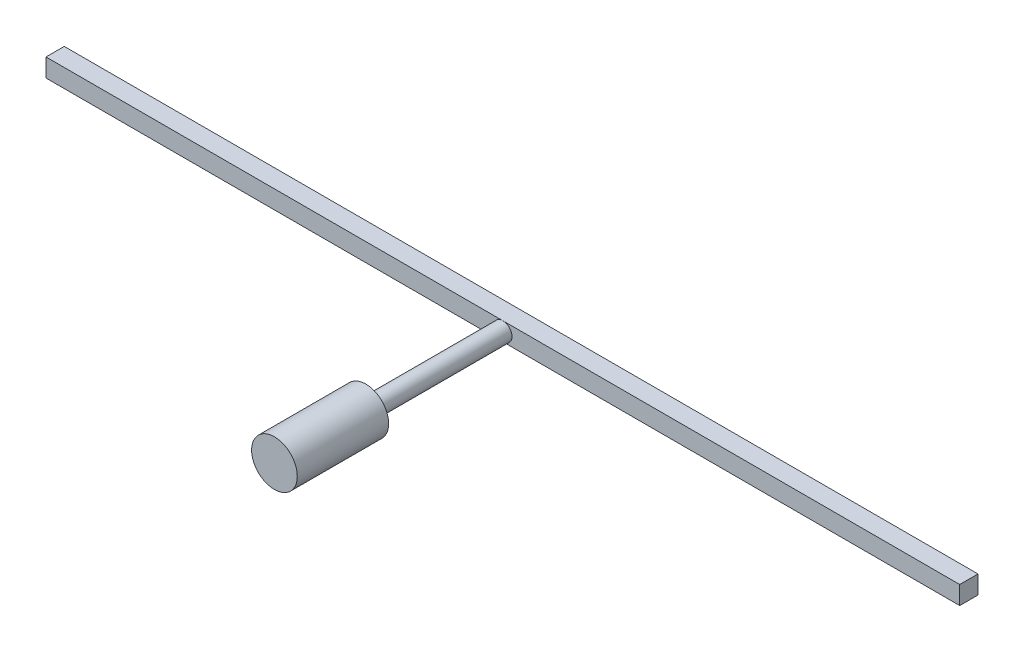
ISO-10303-21;
HEADER;
FILE_DESCRIPTION(('STEP AP214'),'2;1');
FILE_NAME('part.step','',(''),(''),'','','');
FILE_SCHEMA(('AUTOMOTIVE_DESIGN { 1 0 10303 214 1 1 1 1 }'));
ENDSEC;
DATA;
#1=APPLICATION_CONTEXT('core data for automotive mechanical design processes');
#2=APPLICATION_PROTOCOL_DEFINITION('international standard','automotive_design',2000,#1);
#3=PRODUCT_CONTEXT('',#1,'mechanical');
#4=PRODUCT('Part','Part','',(#3));
#5=PRODUCT_RELATED_PRODUCT_CATEGORY('part','',(#4));
#6=PRODUCT_DEFINITION_FORMATION('','',#4);
#7=PRODUCT_DEFINITION_CONTEXT('part definition',#1,'design');
#8=PRODUCT_DEFINITION('design','',#6,#7);
#9=PRODUCT_DEFINITION_SHAPE('','',#8);
#10=(LENGTH_UNIT() NAMED_UNIT(*) SI_UNIT(.MILLI.,.METRE.));
#11=(NAMED_UNIT(*) PLANE_ANGLE_UNIT() SI_UNIT($,.RADIAN.));
#12=(NAMED_UNIT(*) SI_UNIT($,.STERADIAN.) SOLID_ANGLE_UNIT());
#13=UNCERTAINTY_MEASURE_WITH_UNIT(LENGTH_MEASURE(1.E-05),#10,'distance_accuracy_value','');
#14=(GEOMETRIC_REPRESENTATION_CONTEXT(3) GLOBAL_UNCERTAINTY_ASSIGNED_CONTEXT((#13)) GLOBAL_UNIT_ASSIGNED_CONTEXT((#10,
#11,#12)) REPRESENTATION_CONTEXT('',''));
#15=CARTESIAN_POINT('',(0.,0.,0.));
#16=DIRECTION('',(0.,0.,1.));
#17=DIRECTION('',(1.,0.,0.));
#18=AXIS2_PLACEMENT_3D('',#15,#16,#17);
#19=CARTESIAN_POINT('',(0.,0.,-10.));
#20=DIRECTION('',(0.,0.,1.));
#21=DIRECTION('',(1.,0.,0.));
#22=AXIS2_PLACEMENT_3D('',#19,#20,#21);
#23=PLANE('',#22);
#24=CARTESIAN_POINT('',(0.,0.,-10.));
#25=DIRECTION('',(0.,0.,1.));
#26=DIRECTION('',(1.,0.,0.));
#27=AXIS2_PLACEMENT_3D('',#24,#25,#26);
#28=CIRCLE('',#27,5.);
#29=CARTESIAN_POINT('',(5.,0.,-10.));
#30=VERTEX_POINT('',#29);
#31=EDGE_CURVE('E120',#30,#30,#28,.T.);
#32=ORIENTED_EDGE('',*,*,#31,.F.);
#33=EDGE_LOOP('',(#32));
#34=FACE_BOUND('',#33,.T.);
#35=CARTESIAN_POINT('',(0.,0.,-10.));
#36=DIRECTION('',(0.,0.,1.));
#37=DIRECTION('',(1.,0.,0.));
#38=AXIS2_PLACEMENT_3D('',#35,#36,#37);
#39=CIRCLE('',#38,2.);
#40=CARTESIAN_POINT('',(2.,0.,-10.));
#41=VERTEX_POINT('',#40);
#42=EDGE_CURVE('E11',#41,#41,#39,.F.);
#43=ORIENTED_EDGE('',*,*,#42,.F.);
#44=EDGE_LOOP('',(#43));
#45=FACE_BOUND('',#44,.T.);
#46=ADVANCED_FACE('F30',(#34,#45),#23,.F.);
#47=CARTESIAN_POINT('',(0.,0.,10.));
#48=DIRECTION('',(0.,0.,-1.));
#49=DIRECTION('',(-1.,0.,0.));
#50=AXIS2_PLACEMENT_3D('',#47,#48,#49);
#51=CYLINDRICAL_SURFACE('',#50,5.);
#52=CARTESIAN_POINT('',(0.,0.,10.));
#53=DIRECTION('',(0.,0.,1.));
#54=DIRECTION('',(1.,0.,0.));
#55=AXIS2_PLACEMENT_3D('',#52,#53,#54);
#56=CIRCLE('',#55,5.);
#57=CARTESIAN_POINT('',(5.,0.,10.));
#58=VERTEX_POINT('',#57);
#59=EDGE_CURVE('E38',#58,#58,#56,.T.);
#60=ORIENTED_EDGE('',*,*,#59,.F.);
#61=EDGE_LOOP('',(#60));
#62=FACE_BOUND('',#61,.T.);
#63=ORIENTED_EDGE('',*,*,#31,.T.);
#64=EDGE_LOOP('',(#63));
#65=FACE_BOUND('',#64,.T.);
#66=ADVANCED_FACE('F32',(#62,#65),#51,.T.);
#67=CARTESIAN_POINT('',(0.,0.,10.));
#68=DIRECTION('',(0.,0.,1.));
#69=DIRECTION('',(1.,0.,0.));
#70=AXIS2_PLACEMENT_3D('',#67,#68,#69);
#71=PLANE('',#70);
#72=ORIENTED_EDGE('',*,*,#59,.T.);
#73=EDGE_LOOP('',(#72));
#74=FACE_BOUND('',#73,.T.);
#75=ADVANCED_FACE('F128',(#74),#71,.T.);
#76=CARTESIAN_POINT('',(0.,0.,-40.));
#77=DIRECTION('',(0.,0.,1.));
#78=DIRECTION('',(1.,0.,0.));
#79=AXIS2_PLACEMENT_3D('',#76,#77,#78);
#80=CYLINDRICAL_SURFACE('',#79,2.);
#81=CARTESIAN_POINT('',(0.,0.,-40.));
#82=DIRECTION('',(0.,0.,-1.));
#83=DIRECTION('',(-1.,0.,0.));
#84=AXIS2_PLACEMENT_3D('',#81,#82,#83);
#85=CIRCLE('',#84,2.);
#86=CARTESIAN_POINT('',(0.,2.,-40.));
#87=VERTEX_POINT('',#86);
#88=CARTESIAN_POINT('',(0.,-2.,-40.));
#89=VERTEX_POINT('',#88);
#90=EDGE_CURVE('E47',#87,#89,#85,.T.);
#91=ORIENTED_EDGE('',*,*,#90,.F.);
#92=EDGE_CURVE('E44',#89,#87,#85,.T.);
#93=ORIENTED_EDGE('',*,*,#92,.F.);
#94=EDGE_LOOP('',(#91,#93));
#95=FACE_BOUND('',#94,.T.);
#96=ORIENTED_EDGE('',*,*,#42,.T.);
#97=EDGE_LOOP('',(#96));
#98=FACE_BOUND('',#97,.T.);
#99=ADVANCED_FACE('F139',(#95,#98),#80,.T.);
#100=CARTESIAN_POINT('',(100.,-2.,-40.));
#101=DIRECTION('',(0.,0.,-1.));
#102=DIRECTION('',(-1.,0.,0.));
#103=AXIS2_PLACEMENT_3D('',#100,#101,#102);
#104=PLANE('',#103);
#105=DIRECTION('',(1.,0.,0.));
#106=VECTOR('',#105,1.);
#107=CARTESIAN_POINT('',(100.,2.,-40.));
#108=LINE('',#107,#106);
#109=CARTESIAN_POINT('',(100.,2.,-40.));
#110=VERTEX_POINT('',#109);
#111=EDGE_CURVE('E102',#87,#110,#108,.T.);
#112=ORIENTED_EDGE('',*,*,#111,.F.);
#113=ORIENTED_EDGE('',*,*,#90,.T.);
#114=DIRECTION('',(-1.,0.,0.));
#115=VECTOR('',#114,1.);
#116=CARTESIAN_POINT('',(100.,-2.,-40.));
#117=LINE('',#116,#115);
#118=CARTESIAN_POINT('',(100.,-2.,-40.));
#119=VERTEX_POINT('',#118);
#120=EDGE_CURVE('E74',#119,#89,#117,.T.);
#121=ORIENTED_EDGE('',*,*,#120,.F.);
#122=DIRECTION('',(0.,-1.,0.));
#123=VECTOR('',#122,1.);
#124=CARTESIAN_POINT('',(100.,2.,-40.));
#125=LINE('',#124,#123);
#126=EDGE_CURVE('E79',#110,#119,#125,.T.);
#127=ORIENTED_EDGE('',*,*,#126,.F.);
#128=EDGE_LOOP('',(#112,#113,#121,#127));
#129=FACE_BOUND('',#128,.T.);
#130=ADVANCED_FACE('F77',(#129),#104,.F.);
#131=CARTESIAN_POINT('',(-100.,-2.,-40.));
#132=VERTEX_POINT('',#131);
#133=EDGE_CURVE('E83',#89,#132,#117,.T.);
#134=ORIENTED_EDGE('',*,*,#133,.F.);
#135=ORIENTED_EDGE('',*,*,#92,.T.);
#136=CARTESIAN_POINT('',(-100.,2.,-40.));
#137=VERTEX_POINT('',#136);
#138=EDGE_CURVE('E103',#137,#87,#108,.T.);
#139=ORIENTED_EDGE('',*,*,#138,.F.);
#140=DIRECTION('',(0.,1.,0.));
#141=VECTOR('',#140,1.);
#142=CARTESIAN_POINT('',(-100.,2.,-40.));
#143=LINE('',#142,#141);
#144=EDGE_CURVE('E82',#132,#137,#143,.T.);
#145=ORIENTED_EDGE('',*,*,#144,.F.);
#146=EDGE_LOOP('',(#134,#135,#139,#145));
#147=FACE_BOUND('',#146,.T.);
#148=ADVANCED_FACE('F144',(#147),#104,.F.);
#149=CARTESIAN_POINT('',(100.,2.,-44.));
#150=DIRECTION('',(-1.,0.,0.));
#151=DIRECTION('',(0.,0.,1.));
#152=AXIS2_PLACEMENT_3D('',#149,#150,#151);
#153=PLANE('',#152);
#154=ORIENTED_EDGE('',*,*,#126,.T.);
#155=DIRECTION('',(0.,0.,1.));
#156=VECTOR('',#155,1.);
#157=CARTESIAN_POINT('',(100.,-2.,-44.));
#158=LINE('',#157,#156);
#159=CARTESIAN_POINT('',(100.,-2.,-44.));
#160=VERTEX_POINT('',#159);
#161=EDGE_CURVE('E86',#160,#119,#158,.T.);
#162=ORIENTED_EDGE('',*,*,#161,.F.);
#163=DIRECTION('',(0.,-1.,0.));
#164=VECTOR('',#163,1.);
#165=CARTESIAN_POINT('',(100.,2.,-44.));
#166=LINE('',#165,#164);
#167=CARTESIAN_POINT('',(100.,2.,-44.));
#168=VERTEX_POINT('',#167);
#169=EDGE_CURVE('E106',#168,#160,#166,.T.);
#170=ORIENTED_EDGE('',*,*,#169,.F.);
#171=DIRECTION('',(0.,0.,1.));
#172=VECTOR('',#171,1.);
#173=CARTESIAN_POINT('',(100.,2.,-44.));
#174=LINE('',#173,#172);
#175=EDGE_CURVE('E98',#168,#110,#174,.T.);
#176=ORIENTED_EDGE('',*,*,#175,.T.);
#177=EDGE_LOOP('',(#154,#162,#170,#176));
#178=FACE_BOUND('',#177,.T.);
#179=ADVANCED_FACE('F96',(#178),#153,.F.);
#180=CARTESIAN_POINT('',(100.,-2.,-44.));
#181=DIRECTION('',(0.,1.,0.));
#182=DIRECTION('',(0.,0.,1.));
#183=AXIS2_PLACEMENT_3D('',#180,#181,#182);
#184=PLANE('',#183);
#185=ORIENTED_EDGE('',*,*,#120,.T.);
#186=ORIENTED_EDGE('',*,*,#133,.T.);
#187=DIRECTION('',(0.,0.,1.));
#188=VECTOR('',#187,1.);
#189=CARTESIAN_POINT('',(-100.,-2.,-44.));
#190=LINE('',#189,#188);
#191=CARTESIAN_POINT('',(-100.,-2.,-44.));
#192=VERTEX_POINT('',#191);
#193=EDGE_CURVE('E93',#192,#132,#190,.T.);
#194=ORIENTED_EDGE('',*,*,#193,.F.);
#195=DIRECTION('',(-1.,0.,0.));
#196=VECTOR('',#195,1.);
#197=CARTESIAN_POINT('',(100.,-2.,-44.));
#198=LINE('',#197,#196);
#199=EDGE_CURVE('E89',#160,#192,#198,.T.);
#200=ORIENTED_EDGE('',*,*,#199,.F.);
#201=ORIENTED_EDGE('',*,*,#161,.T.);
#202=EDGE_LOOP('',(#185,#186,#194,#200,#201));
#203=FACE_BOUND('',#202,.T.);
#204=ADVANCED_FACE('F87',(#203),#184,.F.);
#205=CARTESIAN_POINT('',(-100.,2.,-44.));
#206=DIRECTION('',(1.,0.,0.));
#207=DIRECTION('',(0.,0.,-1.));
#208=AXIS2_PLACEMENT_3D('',#205,#206,#207);
#209=PLANE('',#208);
#210=ORIENTED_EDGE('',*,*,#144,.T.);
#211=DIRECTION('',(0.,0.,1.));
#212=VECTOR('',#211,1.);
#213=CARTESIAN_POINT('',(-100.,2.,-44.));
#214=LINE('',#213,#212);
#215=CARTESIAN_POINT('',(-100.,2.,-44.));
#216=VERTEX_POINT('',#215);
#217=EDGE_CURVE('E114',#216,#137,#214,.T.);
#218=ORIENTED_EDGE('',*,*,#217,.F.);
#219=DIRECTION('',(0.,1.,0.));
#220=VECTOR('',#219,1.);
#221=CARTESIAN_POINT('',(-100.,2.,-44.));
#222=LINE('',#221,#220);
#223=EDGE_CURVE('E109',#192,#216,#222,.T.);
#224=ORIENTED_EDGE('',*,*,#223,.F.);
#225=ORIENTED_EDGE('',*,*,#193,.T.);
#226=EDGE_LOOP('',(#210,#218,#224,#225));
#227=FACE_BOUND('',#226,.T.);
#228=ADVANCED_FACE('F152',(#227),#209,.F.);
#229=CARTESIAN_POINT('',(100.,2.,-44.));
#230=DIRECTION('',(0.,-1.,0.));
#231=DIRECTION('',(0.,0.,-1.));
#232=AXIS2_PLACEMENT_3D('',#229,#230,#231);
#233=PLANE('',#232);
#234=ORIENTED_EDGE('',*,*,#138,.T.);
#235=ORIENTED_EDGE('',*,*,#111,.T.);
#236=ORIENTED_EDGE('',*,*,#175,.F.);
#237=DIRECTION('',(1.,0.,0.));
#238=VECTOR('',#237,1.);
#239=CARTESIAN_POINT('',(100.,2.,-44.));
#240=LINE('',#239,#238);
#241=EDGE_CURVE('E111',#216,#168,#240,.T.);
#242=ORIENTED_EDGE('',*,*,#241,.F.);
#243=ORIENTED_EDGE('',*,*,#217,.T.);
#244=EDGE_LOOP('',(#234,#235,#236,#242,#243));
#245=FACE_BOUND('',#244,.T.);
#246=ADVANCED_FACE('F155',(#245),#233,.F.);
#247=CARTESIAN_POINT('',(100.,-2.,-44.));
#248=DIRECTION('',(0.,0.,-1.));
#249=DIRECTION('',(-1.,0.,0.));
#250=AXIS2_PLACEMENT_3D('',#247,#248,#249);
#251=PLANE('',#250);
#252=ORIENTED_EDGE('',*,*,#169,.T.);
#253=ORIENTED_EDGE('',*,*,#199,.T.);
#254=ORIENTED_EDGE('',*,*,#223,.T.);
#255=ORIENTED_EDGE('',*,*,#241,.T.);
#256=EDGE_LOOP('',(#252,#253,#254,#255));
#257=FACE_BOUND('',#256,.T.);
#258=ADVANCED_FACE('F159',(#257),#251,.T.);
#259=CLOSED_SHELL('',(#46,#66,#75,#99,#130,#148,#179,#204,#228,#246,#258));
#260=MANIFOLD_SOLID_BREP('B2',#259);
#261=ADVANCED_BREP_SHAPE_REPRESENTATION('',(#18,#260),#14);
#262=SHAPE_DEFINITION_REPRESENTATION(#9,#261);
ENDSEC;
END-ISO-10303-21;
